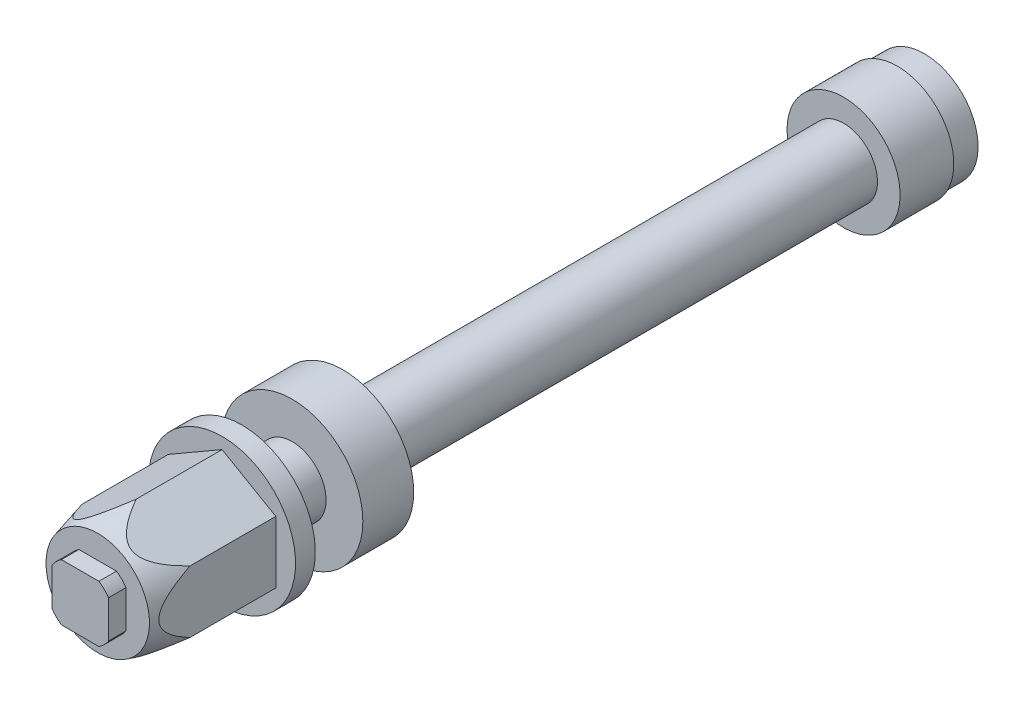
ISO-10303-21;
HEADER;
FILE_DESCRIPTION(('STEP AP214'),'2;1');
FILE_NAME('part.step','',(''),(''),'','','');
FILE_SCHEMA(('AUTOMOTIVE_DESIGN { 1 0 10303 214 1 1 1 1 }'));
ENDSEC;
DATA;
#1=APPLICATION_CONTEXT('core data for automotive mechanical design processes');
#2=APPLICATION_PROTOCOL_DEFINITION('international standard','automotive_design',2000,#1);
#3=PRODUCT_CONTEXT('',#1,'mechanical');
#4=PRODUCT('Part','Part','',(#3));
#5=PRODUCT_RELATED_PRODUCT_CATEGORY('part','',(#4));
#6=PRODUCT_DEFINITION_FORMATION('','',#4);
#7=PRODUCT_DEFINITION_CONTEXT('part definition',#1,'design');
#8=PRODUCT_DEFINITION('design','',#6,#7);
#9=PRODUCT_DEFINITION_SHAPE('','',#8);
#10=(LENGTH_UNIT() NAMED_UNIT(*) SI_UNIT(.MILLI.,.METRE.));
#11=(NAMED_UNIT(*) PLANE_ANGLE_UNIT() SI_UNIT($,.RADIAN.));
#12=(NAMED_UNIT(*) SI_UNIT($,.STERADIAN.) SOLID_ANGLE_UNIT());
#13=UNCERTAINTY_MEASURE_WITH_UNIT(LENGTH_MEASURE(1.E-05),#10,'distance_accuracy_value','');
#14=(GEOMETRIC_REPRESENTATION_CONTEXT(3) GLOBAL_UNCERTAINTY_ASSIGNED_CONTEXT((#13)) GLOBAL_UNIT_ASSIGNED_CONTEXT((#10,
#11,#12)) REPRESENTATION_CONTEXT('',''));
#15=CARTESIAN_POINT('',(0.,0.,0.));
#16=DIRECTION('',(0.,0.,1.));
#17=DIRECTION('',(1.,0.,0.));
#18=AXIS2_PLACEMENT_3D('',#15,#16,#17);
#19=CARTESIAN_POINT('',(-5.,-5.,29.));
#20=DIRECTION('',(0.,0.,1.));
#21=DIRECTION('',(1.,0.,0.));
#22=AXIS2_PLACEMENT_3D('',#19,#20,#21);
#23=PLANE('',#22);
#24=CARTESIAN_POINT('',(0.,0.,29.));
#25=DIRECTION('',(0.,0.,1.));
#26=DIRECTION('',(1.,0.,0.));
#27=AXIS2_PLACEMENT_3D('',#24,#25,#26);
#28=CIRCLE('',#27,6.);
#29=CARTESIAN_POINT('',(-5.00000000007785,-3.31662479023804,29.));
#30=VERTEX_POINT('',#29);
#31=CARTESIAN_POINT('',(-3.31662479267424,-4.99999999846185,29.));
#32=VERTEX_POINT('',#31);
#33=EDGE_CURVE('E335',#30,#32,#28,.T.);
#34=ORIENTED_EDGE('',*,*,#33,.T.);
#35=DIRECTION('',(1.,0.,0.));
#36=VECTOR('',#35,1.);
#37=CARTESIAN_POINT('',(-2.49999603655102E-09,-5.,29.));
#38=LINE('',#37,#36);
#39=CARTESIAN_POINT('',(3.31662479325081,-4.99999999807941,29.));
#40=VERTEX_POINT('',#39);
#41=EDGE_CURVE('E113',#32,#40,#38,.T.);
#42=ORIENTED_EDGE('',*,*,#41,.T.);
#43=CARTESIAN_POINT('',(0.,0.,29.));
#44=DIRECTION('',(0.,0.,1.));
#45=DIRECTION('',(1.,0.,0.));
#46=AXIS2_PLACEMENT_3D('',#43,#44,#45);
#47=CIRCLE('',#46,6.);
#48=CARTESIAN_POINT('',(5.,-3.3166247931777,29.));
#49=VERTEX_POINT('',#48);
#50=EDGE_CURVE('E18',#40,#49,#47,.T.);
#51=ORIENTED_EDGE('',*,*,#50,.T.);
#52=DIRECTION('',(0.,1.,0.));
#53=VECTOR('',#52,1.);
#54=CARTESIAN_POINT('',(5.,-4.99996044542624E-10,29.));
#55=LINE('',#54,#53);
#56=CARTESIAN_POINT('',(5.0000000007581,3.31662478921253,29.));
#57=VERTEX_POINT('',#56);
#58=EDGE_CURVE('E118',#49,#57,#55,.T.);
#59=ORIENTED_EDGE('',*,*,#58,.T.);
#60=CARTESIAN_POINT('',(0.,0.,29.));
#61=DIRECTION('',(0.,0.,1.));
#62=DIRECTION('',(1.,0.,0.));
#63=AXIS2_PLACEMENT_3D('',#60,#61,#62);
#64=CIRCLE('',#63,6.);
#65=CARTESIAN_POINT('',(3.31662479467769,5.,29.));
#66=VERTEX_POINT('',#65);
#67=EDGE_CURVE('E136',#57,#66,#64,.T.);
#68=ORIENTED_EDGE('',*,*,#67,.T.);
#69=DIRECTION('',(-1.,0.,0.));
#70=VECTOR('',#69,1.);
#71=CARTESIAN_POINT('',(1.49999604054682E-09,5.,29.));
#72=LINE('',#71,#70);
#73=CARTESIAN_POINT('',(-3.31662478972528,5.00000000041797,29.));
#74=VERTEX_POINT('',#73);
#75=EDGE_CURVE('E139',#66,#74,#72,.T.);
#76=ORIENTED_EDGE('',*,*,#75,.T.);
#77=CARTESIAN_POINT('',(0.,0.,29.));
#78=DIRECTION('',(0.,0.,1.));
#79=DIRECTION('',(1.,0.,0.));
#80=AXIS2_PLACEMENT_3D('',#77,#78,#79);
#81=CIRCLE('',#80,6.);
#82=CARTESIAN_POINT('',(-5.,3.31662479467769,29.));
#83=VERTEX_POINT('',#82);
#84=EDGE_CURVE('E338',#74,#83,#81,.T.);
#85=ORIENTED_EDGE('',*,*,#84,.T.);
#86=DIRECTION('',(0.,-1.,0.));
#87=VECTOR('',#86,1.);
#88=CARTESIAN_POINT('',(-5.,1.49999604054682E-09,29.));
#89=LINE('',#88,#87);
#90=EDGE_CURVE('E351',#83,#30,#89,.T.);
#91=ORIENTED_EDGE('',*,*,#90,.T.);
#92=EDGE_LOOP('',(#34,#42,#51,#59,#68,#76,#85,#91));
#93=FACE_BOUND('',#92,.T.);
#94=ADVANCED_FACE('F14',(#93),#23,.T.);
#95=CARTESIAN_POINT('',(3.31662479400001,-5.,25.9));
#96=DIRECTION('',(0.,1.,0.));
#97=DIRECTION('',(-1.,0.,0.));
#98=AXIS2_PLACEMENT_3D('',#95,#96,#97);
#99=PLANE('',#98);
#100=DIRECTION('',(0.,0.,1.));
#101=VECTOR('',#100,1.);
#102=CARTESIAN_POINT('',(-3.31662479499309,-4.9999999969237,27.45));
#103=LINE('',#102,#101);
#104=CARTESIAN_POINT('',(-3.31662479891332,-4.99999999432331,25.9));
#105=VERTEX_POINT('',#104);
#106=EDGE_CURVE('E352',#32,#105,#103,.F.);
#107=ORIENTED_EDGE('',*,*,#106,.T.);
#108=DIRECTION('',(1.,0.,0.));
#109=VECTOR('',#108,1.);
#110=CARTESIAN_POINT('',(0.,-4.99999999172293,25.9));
#111=LINE('',#110,#109);
#112=CARTESIAN_POINT('',(3.31662479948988,-4.99999999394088,25.9));
#113=VERTEX_POINT('',#112);
#114=EDGE_CURVE('E334',#105,#113,#111,.T.);
#115=ORIENTED_EDGE('',*,*,#114,.T.);
#116=DIRECTION('',(0.,0.,-1.));
#117=VECTOR('',#116,1.);
#118=CARTESIAN_POINT('',(3.3166247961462,-4.99999999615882,27.45));
#119=LINE('',#118,#117);
#120=EDGE_CURVE('E123',#113,#40,#119,.F.);
#121=ORIENTED_EDGE('',*,*,#120,.T.);
#122=ORIENTED_EDGE('',*,*,#41,.F.);
#123=EDGE_LOOP('',(#107,#115,#121,#122));
#124=FACE_BOUND('',#123,.T.);
#125=ADVANCED_FACE('F277',(#124),#99,.F.);
#126=CARTESIAN_POINT('',(0.,0.,25.9));
#127=DIRECTION('',(0.,0.,1.));
#128=DIRECTION('',(1.,0.,0.));
#129=AXIS2_PLACEMENT_3D('',#126,#127,#128);
#130=CYLINDRICAL_SURFACE('',#129,6.);
#131=ORIENTED_EDGE('',*,*,#120,.F.);
#132=CARTESIAN_POINT('',(0.,0.,25.9));
#133=DIRECTION('',(0.,0.,1.));
#134=DIRECTION('',(1.,0.,0.));
#135=AXIS2_PLACEMENT_3D('',#132,#133,#134);
#136=CIRCLE('',#135,6.);
#137=CARTESIAN_POINT('',(4.99999999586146,-3.31662479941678,25.9));
#138=VERTEX_POINT('',#137);
#139=EDGE_CURVE('E127',#113,#138,#136,.T.);
#140=ORIENTED_EDGE('',*,*,#139,.T.);
#141=DIRECTION('',(0.,0.,1.));
#142=VECTOR('',#141,1.);
#143=CARTESIAN_POINT('',(5.,-3.316624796,27.45));
#144=LINE('',#143,#142);
#145=EDGE_CURVE('E122',#138,#49,#144,.T.);
#146=ORIENTED_EDGE('',*,*,#145,.T.);
#147=ORIENTED_EDGE('',*,*,#50,.F.);
#148=EDGE_LOOP('',(#131,#140,#146,#147));
#149=FACE_BOUND('',#148,.T.);
#150=ADVANCED_FACE('F125',(#149),#130,.T.);
#151=CARTESIAN_POINT('',(5.,3.31662479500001,25.9));
#152=DIRECTION('',(-1.,0.,0.));
#153=DIRECTION('',(0.,-1.,0.));
#154=AXIS2_PLACEMENT_3D('',#151,#152,#153);
#155=PLANE('',#154);
#156=ORIENTED_EDGE('',*,*,#145,.F.);
#157=DIRECTION('',(0.,1.,0.));
#158=VECTOR('',#157,1.);
#159=CARTESIAN_POINT('',(4.99999999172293,0.,25.9));
#160=LINE('',#159,#158);
#161=CARTESIAN_POINT('',(4.99999999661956,3.31662479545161,25.9));
#162=VERTEX_POINT('',#161);
#163=EDGE_CURVE('E332',#138,#162,#160,.T.);
#164=ORIENTED_EDGE('',*,*,#163,.T.);
#165=DIRECTION('',(0.,0.,-1.));
#166=VECTOR('',#165,1.);
#167=CARTESIAN_POINT('',(5.0000000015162,3.31662478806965,27.45));
#168=LINE('',#167,#166);
#169=EDGE_CURVE('E133',#162,#57,#168,.F.);
#170=ORIENTED_EDGE('',*,*,#169,.T.);
#171=ORIENTED_EDGE('',*,*,#58,.F.);
#172=EDGE_LOOP('',(#156,#164,#170,#171));
#173=FACE_BOUND('',#172,.T.);
#174=ADVANCED_FACE('F131',(#173),#155,.F.);
#175=CARTESIAN_POINT('',(0.,0.,25.9));
#176=DIRECTION('',(0.,0.,1.));
#177=DIRECTION('',(1.,0.,0.));
#178=AXIS2_PLACEMENT_3D('',#175,#176,#177);
#179=CYLINDRICAL_SURFACE('',#178,6.);
#180=ORIENTED_EDGE('',*,*,#169,.F.);
#181=CARTESIAN_POINT('',(0.,0.,25.9));
#182=DIRECTION('',(0.,0.,1.));
#183=DIRECTION('',(1.,0.,0.));
#184=AXIS2_PLACEMENT_3D('',#181,#182,#183);
#185=CIRCLE('',#184,6.);
#186=CARTESIAN_POINT('',(3.31662480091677,4.99999999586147,25.9));
#187=VERTEX_POINT('',#186);
#188=EDGE_CURVE('E330',#162,#187,#185,.T.);
#189=ORIENTED_EDGE('',*,*,#188,.T.);
#190=DIRECTION('',(0.,0.,1.));
#191=VECTOR('',#190,1.);
#192=CARTESIAN_POINT('',(3.316624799,5.,27.45));
#193=LINE('',#192,#191);
#194=EDGE_CURVE('E341',#187,#66,#193,.T.);
#195=ORIENTED_EDGE('',*,*,#194,.T.);
#196=ORIENTED_EDGE('',*,*,#67,.F.);
#197=EDGE_LOOP('',(#180,#189,#195,#196));
#198=FACE_BOUND('',#197,.T.);
#199=ADVANCED_FACE('F283',(#198),#179,.T.);
#200=CARTESIAN_POINT('',(-3.31662479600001,5.,25.9));
#201=DIRECTION('',(0.,-1.,0.));
#202=DIRECTION('',(1.,0.,0.));
#203=AXIS2_PLACEMENT_3D('',#200,#201,#202);
#204=PLANE('',#203);
#205=ORIENTED_EDGE('',*,*,#194,.F.);
#206=DIRECTION('',(-1.,0.,0.));
#207=VECTOR('',#206,1.);
#208=CARTESIAN_POINT('',(0.,4.99999999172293,25.9));
#209=LINE('',#208,#207);
#210=CARTESIAN_POINT('',(-3.31662479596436,4.99999999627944,25.9));
#211=VERTEX_POINT('',#210);
#212=EDGE_CURVE('E329',#187,#211,#209,.T.);
#213=ORIENTED_EDGE('',*,*,#212,.T.);
#214=DIRECTION('',(0.,0.,-1.));
#215=VECTOR('',#214,1.);
#216=CARTESIAN_POINT('',(-3.31662478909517,5.00000000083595,27.45));
#217=LINE('',#216,#215);
#218=EDGE_CURVE('E340',#211,#74,#217,.F.);
#219=ORIENTED_EDGE('',*,*,#218,.T.);
#220=ORIENTED_EDGE('',*,*,#75,.F.);
#221=EDGE_LOOP('',(#205,#213,#219,#220));
#222=FACE_BOUND('',#221,.T.);
#223=ADVANCED_FACE('F284',(#222),#204,.F.);
#224=CARTESIAN_POINT('',(0.,0.,25.9));
#225=DIRECTION('',(0.,0.,1.));
#226=DIRECTION('',(1.,0.,0.));
#227=AXIS2_PLACEMENT_3D('',#224,#225,#226);
#228=CYLINDRICAL_SURFACE('',#227,6.);
#229=ORIENTED_EDGE('',*,*,#218,.F.);
#230=CARTESIAN_POINT('',(0.,0.,25.9));
#231=DIRECTION('',(0.,0.,1.));
#232=DIRECTION('',(1.,0.,0.));
#233=AXIS2_PLACEMENT_3D('',#230,#231,#232);
#234=CIRCLE('',#233,6.);
#235=CARTESIAN_POINT('',(-4.99999999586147,3.31662480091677,25.9));
#236=VERTEX_POINT('',#235);
#237=EDGE_CURVE('E327',#211,#236,#234,.T.);
#238=ORIENTED_EDGE('',*,*,#237,.T.);
#239=DIRECTION('',(0.,0.,1.));
#240=VECTOR('',#239,1.);
#241=CARTESIAN_POINT('',(-5.,3.316624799,27.45));
#242=LINE('',#241,#240);
#243=EDGE_CURVE('E339',#236,#83,#242,.T.);
#244=ORIENTED_EDGE('',*,*,#243,.T.);
#245=ORIENTED_EDGE('',*,*,#84,.F.);
#246=EDGE_LOOP('',(#229,#238,#244,#245));
#247=FACE_BOUND('',#246,.T.);
#248=ADVANCED_FACE('F287',(#247),#228,.T.);
#249=CARTESIAN_POINT('',(-5.,-3.31662479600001,25.9));
#250=DIRECTION('',(1.,0.,0.));
#251=DIRECTION('',(0.,1.,0.));
#252=AXIS2_PLACEMENT_3D('',#249,#250,#251);
#253=PLANE('',#252);
#254=ORIENTED_EDGE('',*,*,#243,.F.);
#255=DIRECTION('',(0.,-1.,0.));
#256=VECTOR('',#255,1.);
#257=CARTESIAN_POINT('',(-4.99999999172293,0.,25.9));
#258=LINE('',#257,#256);
#259=CARTESIAN_POINT('',(-4.99999999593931,-3.31662479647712,25.9));
#260=VERTEX_POINT('',#259);
#261=EDGE_CURVE('E326',#236,#260,#258,.T.);
#262=ORIENTED_EDGE('',*,*,#261,.T.);
#263=DIRECTION('',(0.,0.,-1.));
#264=VECTOR('',#263,1.);
#265=CARTESIAN_POINT('',(-5.0000000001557,-3.31662479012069,27.45));
#266=LINE('',#265,#264);
#267=EDGE_CURVE('E337',#260,#30,#266,.F.);
#268=ORIENTED_EDGE('',*,*,#267,.T.);
#269=ORIENTED_EDGE('',*,*,#90,.F.);
#270=EDGE_LOOP('',(#254,#262,#268,#269));
#271=FACE_BOUND('',#270,.T.);
#272=ADVANCED_FACE('F289',(#271),#253,.F.);
#273=CARTESIAN_POINT('',(0.,0.,25.9));
#274=DIRECTION('',(0.,0.,1.));
#275=DIRECTION('',(1.,0.,0.));
#276=AXIS2_PLACEMENT_3D('',#273,#274,#275);
#277=CYLINDRICAL_SURFACE('',#276,6.);
#278=ORIENTED_EDGE('',*,*,#267,.F.);
#279=CARTESIAN_POINT('',(0.,0.,25.9));
#280=DIRECTION('',(0.,0.,1.));
#281=DIRECTION('',(1.,0.,0.));
#282=AXIS2_PLACEMENT_3D('',#279,#280,#281);
#283=CIRCLE('',#282,6.);
#284=EDGE_CURVE('E323',#260,#105,#283,.T.);
#285=ORIENTED_EDGE('',*,*,#284,.T.);
#286=ORIENTED_EDGE('',*,*,#106,.F.);
#287=ORIENTED_EDGE('',*,*,#33,.F.);
#288=EDGE_LOOP('',(#278,#285,#286,#287));
#289=FACE_BOUND('',#288,.T.);
#290=ADVANCED_FACE('F292',(#289),#277,.T.);
#291=CARTESIAN_POINT('',(9.26080236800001,-9.26080236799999,25.9));
#292=DIRECTION('',(0.,0.,-1.));
#293=DIRECTION('',(-1.,0.,0.));
#294=AXIS2_PLACEMENT_3D('',#291,#292,#293);
#295=PLANE('',#294);
#296=ORIENTED_EDGE('',*,*,#261,.F.);
#297=ORIENTED_EDGE('',*,*,#237,.F.);
#298=ORIENTED_EDGE('',*,*,#212,.F.);
#299=ORIENTED_EDGE('',*,*,#188,.F.);
#300=ORIENTED_EDGE('',*,*,#163,.F.);
#301=ORIENTED_EDGE('',*,*,#139,.F.);
#302=ORIENTED_EDGE('',*,*,#114,.F.);
#303=ORIENTED_EDGE('',*,*,#284,.F.);
#304=EDGE_LOOP('',(#296,#297,#298,#299,#300,#301,#302,#303));
#305=FACE_BOUND('',#304,.T.);
#306=CARTESIAN_POINT('',(0.,0.,25.9));
#307=DIRECTION('',(0.,0.,-1.));
#308=DIRECTION('',(-1.,0.,0.));
#309=AXIS2_PLACEMENT_3D('',#306,#307,#308);
#310=CIRCLE('',#309,9.15099048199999);
#311=CARTESIAN_POINT('',(-9.15099048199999,0.,25.9));
#312=VERTEX_POINT('',#311);
#313=EDGE_CURVE('E315',#312,#312,#310,.F.);
#314=ORIENTED_EDGE('',*,*,#313,.T.);
#315=EDGE_LOOP('',(#314));
#316=FACE_BOUND('',#315,.T.);
#317=ADVANCED_FACE('F294',(#305,#316),#295,.F.);
#318=CARTESIAN_POINT('',(0.,0.,25.9));
#319=DIRECTION('',(0.,0.,-1.));
#320=DIRECTION('',(-1.,0.,0.));
#321=AXIS2_PLACEMENT_3D('',#318,#319,#320);
#322=CONICAL_SURFACE('',#321,9.150990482,0.261799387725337);
#323=CARTESIAN_POINT('',(-6.20868162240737E-09,10.9696551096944,19.1126511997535));
#324=CARTESIAN_POINT('',(-0.0634488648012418,10.9330228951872,19.2493562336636));
#325=CARTESIAN_POINT('',(-0.127631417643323,10.8959670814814,19.3856060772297));
#326=CARTESIAN_POINT('',(-0.257633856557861,10.8209101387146,19.6570747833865));
#327=CARTESIAN_POINT('',(-0.323453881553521,10.7829089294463,19.7922935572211));
#328=CARTESIAN_POINT('',(-0.523848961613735,10.667210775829,20.1966722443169));
#329=CARTESIAN_POINT('',(-0.661131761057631,10.5879505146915,20.4640613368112));
#330=CARTESIAN_POINT('',(-0.946289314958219,10.4233147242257,20.9956178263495));
#331=CARTESIAN_POINT('',(-1.09427022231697,10.3378779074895,21.2597096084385));
#332=CARTESIAN_POINT('',(-1.40172472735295,10.1603689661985,21.778663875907));
#333=CARTESIAN_POINT('',(-1.56118902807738,10.0683022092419,22.0335335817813));
#334=CARTESIAN_POINT('',(-1.80700454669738,9.92638055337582,22.3987192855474));
#335=CARTESIAN_POINT('',(-1.88749663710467,9.87990842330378,22.5142972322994));
#336=CARTESIAN_POINT('',(-2.05236072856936,9.78472409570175,22.7417441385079));
#337=CARTESIAN_POINT('',(-2.1367331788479,9.7360116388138,22.8536126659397));
#338=CARTESIAN_POINT('',(-2.30985609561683,9.63605907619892,23.0726406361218));
#339=CARTESIAN_POINT('',(-2.39860372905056,9.58482060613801,23.1798030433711));
#340=CARTESIAN_POINT('',(-2.58115638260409,9.47942378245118,23.3881875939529));
#341=CARTESIAN_POINT('',(-2.67496035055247,9.4252660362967,23.4894109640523));
#342=CARTESIAN_POINT('',(-2.92331830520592,9.28187650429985,23.7396866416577));
#343=CARTESIAN_POINT('',(-3.08212147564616,9.19019145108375,23.8832583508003));
#344=CARTESIAN_POINT('',(-3.41643833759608,8.9971735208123,24.1416779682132));
#345=CARTESIAN_POINT('',(-3.59190139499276,8.89586987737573,24.2566092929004));
#346=CARTESIAN_POINT('',(-3.8986995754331,8.71873986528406,24.4120548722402));
#347=CARTESIAN_POINT('',(-4.02538741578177,8.64559660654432,24.4646084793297));
#348=CARTESIAN_POINT('',(-4.2845097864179,8.49599223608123,24.5451218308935));
#349=CARTESIAN_POINT('',(-4.41693645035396,8.41953566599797,24.573114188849));
#350=CARTESIAN_POINT('',(-4.68483156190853,8.26486635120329,24.6010793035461));
#351=CARTESIAN_POINT('',(-4.82031300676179,8.18664610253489,24.6008921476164));
#352=CARTESIAN_POINT('',(-5.088980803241,8.0315306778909,24.572131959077));
#353=CARTESIAN_POINT('',(-5.22216570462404,7.95463633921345,24.5435416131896));
#354=CARTESIAN_POINT('',(-5.51004033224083,7.78843184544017,24.4529690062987));
#355=CARTESIAN_POINT('',(-5.6633373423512,7.69992577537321,24.3852134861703));
#356=CARTESIAN_POINT('',(-5.95867005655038,7.5294153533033,24.2225226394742));
#357=CARTESIAN_POINT('',(-6.10067910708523,7.44742638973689,24.1275252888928));
#358=CARTESIAN_POINT('',(-6.35825831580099,7.29871296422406,23.9300827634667));
#359=CARTESIAN_POINT('',(-6.47501165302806,7.23130539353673,23.8296450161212));
#360=CARTESIAN_POINT('',(-6.70072155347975,7.1009917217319,23.6175948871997));
#361=CARTESIAN_POINT('',(-6.80967100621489,7.03808972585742,23.5059725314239));
#362=CARTESIAN_POINT('',(-7.02146523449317,6.91581027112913,23.2736789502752));
#363=CARTESIAN_POINT('',(-7.12426171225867,6.85646069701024,23.1529496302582));
#364=CARTESIAN_POINT('',(-7.3238811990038,6.74121033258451,22.905214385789));
#365=CARTESIAN_POINT('',(-7.42070658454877,6.68530817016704,22.7782109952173));
#366=CARTESIAN_POINT('',(-7.6148771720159,6.57320372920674,22.511647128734));
#367=CARTESIAN_POINT('',(-7.71191369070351,6.51717966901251,22.3717884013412));
#368=CARTESIAN_POINT('',(-7.90115733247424,6.40791980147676,22.0877653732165));
#369=CARTESIAN_POINT('',(-7.99336354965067,6.35468451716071,21.9436002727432));
#370=CARTESIAN_POINT('',(-8.26401505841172,6.19842379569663,21.5056561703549));
#371=CARTESIAN_POINT('',(-8.43625499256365,6.09898102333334,21.2067650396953));
#372=CARTESIAN_POINT('',(-8.76209449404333,5.91085749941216,20.611274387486));
#373=CARTESIAN_POINT('',(-8.91614852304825,5.82191436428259,20.3150011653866));
#374=CARTESIAN_POINT('',(-9.1401546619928,5.6925843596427,19.8665652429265));
#375=CARTESIAN_POINT('',(-9.21352966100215,5.65022128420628,19.7166646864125));
#376=CARTESIAN_POINT('',(-9.35823700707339,5.56667445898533,19.4155785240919));
#377=CARTESIAN_POINT('',(-9.42956961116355,5.52549056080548,19.2643930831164));
#378=CARTESIAN_POINT('',(-9.49999999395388,5.48482756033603,19.1126512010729));
#379=B_SPLINE_CURVE_WITH_KNOTS('',3,(#323,#324,#325,#326,#327,#328,#329,#330,#331,#332,#333,
#334,#335,#336,#337,#338,#339,#340,#341,#342,#343,#344,#345,#346,#347,#348,#349,#350,#351,#352,
#353,#354,#355,#356,#357,#358,#359,#360,#361,#362,#363,#364,#365,#366,#367,#368,#369,#370,#371,
#372,#373,#374,#375,#376,#377,#378),.UNSPECIFIED.,.F.,.F.,(4,2,2,2,2,2,2,2,2,2,2,2,2,2,2,2,2,2,
2,2,2,2,2,2,2,2,2,4),(0.,0.46529257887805,0.930624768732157,1.86296450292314,2.80634177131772,
3.74896368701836,4.19381456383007,4.63871707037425,5.08333517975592,5.52786112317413,
6.22481389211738,6.91971238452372,7.38431302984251,7.84829582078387,8.31491171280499,
8.78181220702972,9.34723824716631,9.91396200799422,10.4175759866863,10.9216431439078,
11.4292537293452,11.9366609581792,12.4741121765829,13.0116638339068,14.0880685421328,
15.1245428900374,15.6410886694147,16.1575691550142),.UNSPECIFIED.);
#380=CARTESIAN_POINT('',(0.,10.9696551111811,19.1126511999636));
#381=VERTEX_POINT('',#380);
#382=CARTESIAN_POINT('',(-9.49999999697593,5.48482755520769,19.1126512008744));
#383=VERTEX_POINT('',#382);
#384=EDGE_CURVE('E203',#381,#383,#379,.T.);
#385=ORIENTED_EDGE('',*,*,#384,.T.);
#386=CARTESIAN_POINT('',(-9.49999999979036,5.48482755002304,19.1126512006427));
#387=CARTESIAN_POINT('',(-9.49999999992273,5.41128480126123,19.2498754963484));
#388=CARTESIAN_POINT('',(-9.49999999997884,5.33688846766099,19.3866411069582));
#389=CARTESIAN_POINT('',(-9.50000000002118,5.18619002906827,19.6591330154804));
#390=CARTESIAN_POINT('',(-9.5000000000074,5.1098877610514,19.7948592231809));
#391=CARTESIAN_POINT('',(-9.4999999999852,4.87756577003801,20.2007453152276));
#392=CARTESIAN_POINT('',(-9.49999999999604,4.71839330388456,20.4691194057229));
#393=CARTESIAN_POINT('',(-9.50000000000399,4.38896415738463,21.0005762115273));
#394=CARTESIAN_POINT('',(-9.50000000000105,4.21866340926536,21.263631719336));
#395=CARTESIAN_POINT('',(-9.49999999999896,3.86487531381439,21.7805721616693));
#396=CARTESIAN_POINT('',(-9.49999999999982,3.68139851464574,22.0344641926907));
#397=CARTESIAN_POINT('',(-9.50000000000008,3.40393890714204,22.3914366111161));
#398=CARTESIAN_POINT('',(-9.50000000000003,3.31688903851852,22.4999128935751));
#399=CARTESIAN_POINT('',(-9.49999999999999,3.13888608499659,22.7136397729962));
#400=CARTESIAN_POINT('',(-9.5,3.04793278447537,22.818890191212));
#401=CARTESIAN_POINT('',(-9.50000000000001,2.86131579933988,23.0257346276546));
#402=CARTESIAN_POINT('',(-9.5,2.76563859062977,23.127316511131));
#403=CARTESIAN_POINT('',(-9.50000000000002,2.56923610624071,23.325466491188));
#404=CARTESIAN_POINT('',(-9.50000000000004,2.46851150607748,23.422035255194));
#405=CARTESIAN_POINT('',(-9.49999999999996,2.25954610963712,23.6104173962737));
#406=CARTESIAN_POINT('',(-9.49999999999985,2.15120799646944,23.7021246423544));
#407=CARTESIAN_POINT('',(-9.50000000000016,1.92793405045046,23.8770554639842));
#408=CARTESIAN_POINT('',(-9.50000000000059,1.81299577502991,23.9602758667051));
#409=CARTESIAN_POINT('',(-9.49999999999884,1.45836098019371,24.1925819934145));
#410=CARTESIAN_POINT('',(-9.49999999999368,1.20721115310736,24.3258820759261));
#411=CARTESIAN_POINT('',(-9.5000000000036,0.791928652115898,24.4789033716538));
#412=CARTESIAN_POINT('',(-9.50000000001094,0.636775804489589,24.5228166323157));
#413=CARTESIAN_POINT('',(-9.49999999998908,0.321082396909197,24.5820894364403));
#414=CARTESIAN_POINT('',(-9.49999999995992,0.160549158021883,24.597486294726));
#415=CARTESIAN_POINT('',(-9.49999999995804,-0.169756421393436,24.5974707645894));
#416=CARTESIAN_POINT('',(-9.49999999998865,-0.339530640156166,24.5802408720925));
#417=CARTESIAN_POINT('',(-9.50000000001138,-0.672828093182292,24.5141336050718));
#418=CARTESIAN_POINT('',(-9.50000000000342,-0.836339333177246,24.4651984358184));
#419=CARTESIAN_POINT('',(-9.49999999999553,-1.20174866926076,24.3232046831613));
#420=CARTESIAN_POINT('',(-9.4999999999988,-1.40009749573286,24.2212298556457));
#421=CARTESIAN_POINT('',(-9.50000000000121,-1.77876953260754,23.9881273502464));
#422=CARTESIAN_POINT('',(-9.50000000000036,-1.95903926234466,23.8569166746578));
#423=CARTESIAN_POINT('',(-9.49999999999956,-2.34427513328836,23.5421996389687));
#424=CARTESIAN_POINT('',(-9.49999999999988,-2.5450493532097,23.3536562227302));
#425=CARTESIAN_POINT('',(-9.50000000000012,-2.92786371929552,22.9581956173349));
#426=CARTESIAN_POINT('',(-9.50000000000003,-3.10986608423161,22.7512428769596));
#427=CARTESIAN_POINT('',(-9.49999999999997,-3.46019665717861,22.3240031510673));
#428=CARTESIAN_POINT('',(-9.49999999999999,-3.62843064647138,22.1036398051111));
#429=CARTESIAN_POINT('',(-9.50000000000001,-3.95301175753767,21.6546847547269));
#430=CARTESIAN_POINT('',(-9.5,-4.10936844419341,21.4260998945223));
#431=CARTESIAN_POINT('',(-9.5,-4.37214622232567,21.0247328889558));
#432=CARTESIAN_POINT('',(-9.5,-4.48074507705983,20.8533638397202));
#433=CARTESIAN_POINT('',(-9.5,-4.69361338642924,20.5079259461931));
#434=CARTESIAN_POINT('',(-9.5,-4.79788220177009,20.3338567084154));
#435=CARTESIAN_POINT('',(-9.5,-5.00107097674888,19.9862317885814));
#436=CARTESIAN_POINT('',(-9.5,-5.10004869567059,19.8127097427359));
#437=CARTESIAN_POINT('',(-9.5,-5.29475670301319,19.4639201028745));
#438=CARTESIAN_POINT('',(-9.5,-5.39048796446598,19.2886530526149));
#439=CARTESIAN_POINT('',(-9.5,-5.48482754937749,19.1126512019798));
#440=B_SPLINE_CURVE_WITH_KNOTS('',3,(#386,#387,#388,#389,#390,#391,#392,#393,#394,#395,#396,
#397,#398,#399,#400,#401,#402,#403,#404,#405,#406,#407,#408,#409,#410,#411,#412,#413,#414,#415,
#416,#417,#418,#419,#420,#421,#422,#423,#424,#425,#426,#427,#428,#429,#430,#431,#432,#433,#434,
#435,#436,#437,#438,#439),.UNSPECIFIED.,.F.,.F.,(4,2,2,2,2,2,2,2,2,2,2,2,2,2,2,2,2,2,2,2,2,2,2,
2,2,2,4),(0.,0.467059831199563,0.934159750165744,1.87003517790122,2.8098722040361,
3.74896505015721,4.16614936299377,4.5833567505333,5.00183697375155,5.42026133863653,
5.84566206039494,6.27122124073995,7.11561088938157,7.59717765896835,8.0781138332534,
8.58663100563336,9.09607775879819,9.76129215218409,10.4284196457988,11.2527677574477,
12.0787438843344,12.909967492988,13.7405144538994,14.3490945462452,14.9577641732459,
15.5570273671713,16.1561093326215),.UNSPECIFIED.);
#441=CARTESIAN_POINT('',(-9.49999999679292,-5.48482755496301,19.1126512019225));
#442=VERTEX_POINT('',#441);
#443=EDGE_CURVE('E373',#383,#442,#440,.T.);
#444=ORIENTED_EDGE('',*,*,#443,.T.);
#445=CARTESIAN_POINT('',(-9.49999999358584,-5.48482756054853,19.1126512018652));
#446=CARTESIAN_POINT('',(-9.43655113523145,-5.5214597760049,19.2493562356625));
#447=CARTESIAN_POINT('',(-9.3723685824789,-5.55851559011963,19.3856060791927));
#448=CARTESIAN_POINT('',(-9.24236614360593,-5.63357253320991,19.6570747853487));
#449=CARTESIAN_POINT('',(-9.17654611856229,-5.67157374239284,19.7922935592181));
#450=CARTESIAN_POINT('',(-8.9761510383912,-5.78727189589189,20.1966722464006));
#451=CARTESIAN_POINT('',(-8.83886823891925,-5.86653215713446,20.4640613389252));
#452=CARTESIAN_POINT('',(-8.55371068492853,-6.03116794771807,20.9956178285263));
#453=CARTESIAN_POINT('',(-8.40572977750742,-6.11660476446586,21.2597096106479));
#454=CARTESIAN_POINT('',(-8.09827527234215,-6.29411370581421,21.778663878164));
#455=CARTESIAN_POINT('',(-7.93881097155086,-6.38618046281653,22.0335335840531));
#456=CARTESIAN_POINT('',(-7.69299545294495,-6.52810211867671,22.3987192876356));
#457=CARTESIAN_POINT('',(-7.61250336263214,-6.57457424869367,22.5142972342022));
#458=CARTESIAN_POINT('',(-7.44763927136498,-6.66975857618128,22.7417441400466));
#459=CARTESIAN_POINT('',(-7.36326682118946,-6.71847103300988,22.8536126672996));
#460=CARTESIAN_POINT('',(-7.19014390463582,-6.81842359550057,23.0726406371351));
#461=CARTESIAN_POINT('',(-7.1013962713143,-6.86966206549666,23.1798030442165));
#462=CARTESIAN_POINT('',(-6.91884361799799,-6.97505888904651,23.388187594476));
#463=CARTESIAN_POINT('',(-6.82503965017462,-7.02921663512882,23.4894109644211));
#464=CARTESIAN_POINT('',(-6.57668169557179,-7.17260616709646,23.739686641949));
#465=CARTESIAN_POINT('',(-6.41787852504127,-7.26429122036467,23.8832583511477));
#466=CARTESIAN_POINT('',(-6.08356166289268,-7.45730915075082,24.1416779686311));
#467=CARTESIAN_POINT('',(-5.90809860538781,-7.55861279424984,24.2566092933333));
#468=CARTESIAN_POINT('',(-5.60130042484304,-7.73574280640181,24.4120548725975));
#469=CARTESIAN_POINT('',(-5.47461258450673,-7.80888606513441,24.4646084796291));
#470=CARTESIAN_POINT('',(-5.21549021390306,-7.95849043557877,24.545121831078));
#471=CARTESIAN_POINT('',(-5.08306354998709,-8.03494700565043,24.5731141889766));
#472=CARTESIAN_POINT('',(-4.81516843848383,-8.18961632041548,24.6010793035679));
#473=CARTESIAN_POINT('',(-4.67968699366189,-8.2678365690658,24.6008921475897));
#474=CARTESIAN_POINT('',(-4.41101919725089,-8.42295199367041,24.5721319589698));
#475=CARTESIAN_POINT('',(-4.27783429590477,-8.49984633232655,24.5435416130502));
#476=CARTESIAN_POINT('',(-3.98995966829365,-8.66605082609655,24.4529690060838));
#477=CARTESIAN_POINT('',(-3.83666265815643,-8.75455689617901,24.3852134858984));
#478=CARTESIAN_POINT('',(-3.54132994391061,-8.92506731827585,24.2225226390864));
#479=CARTESIAN_POINT('',(-3.39932089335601,-9.00705628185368,24.1275252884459));
#480=CARTESIAN_POINT('',(-3.14174168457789,-9.15576970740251,23.9300827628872));
#481=CARTESIAN_POINT('',(-3.02498834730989,-9.22317727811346,23.8296450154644));
#482=CARTESIAN_POINT('',(-2.7992784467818,-9.35349094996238,23.6175948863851));
#483=CARTESIAN_POINT('',(-2.69032899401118,-9.41639294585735,23.5059725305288));
#484=CARTESIAN_POINT('',(-2.47853476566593,-9.53867240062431,23.2736789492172));
#485=CARTESIAN_POINT('',(-2.37573828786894,-9.59802197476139,23.152949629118));
#486=CARTESIAN_POINT('',(-2.17611880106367,-9.71327233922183,22.9052143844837));
#487=CARTESIAN_POINT('',(-2.07929341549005,-9.76917450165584,22.778210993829));
#488=CARTESIAN_POINT('',(-1.88512282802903,-9.88127894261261,22.5116471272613));
#489=CARTESIAN_POINT('',(-1.78808630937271,-9.93730300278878,22.3717883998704));
#490=CARTESIAN_POINT('',(-1.5988426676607,-10.0465628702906,22.0877653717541));
#491=CARTESIAN_POINT('',(-1.5066364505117,-10.0997981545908,21.9436002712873));
#492=CARTESIAN_POINT('',(-1.23598494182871,-10.2560588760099,21.5056561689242));
#493=CARTESIAN_POINT('',(-1.06374500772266,-10.3555016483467,21.2067650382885));
#494=CARTESIAN_POINT('',(-0.737905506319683,-10.5436251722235,20.6112743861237));
#495=CARTESIAN_POINT('',(-0.583851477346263,-10.6325683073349,20.3150011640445));
#496=CARTESIAN_POINT('',(-0.359845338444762,-10.76189831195,19.8665652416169));
#497=CARTESIAN_POINT('',(-0.286470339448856,-10.8042613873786,19.7166646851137));
#498=CARTESIAN_POINT('',(-0.141762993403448,-10.8878082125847,19.4155785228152));
#499=CARTESIAN_POINT('',(-0.0704303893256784,-10.9289921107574,19.2643930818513));
#500=CARTESIAN_POINT('',(-6.54730727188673E-09,-10.9696551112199,19.1126511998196));
#501=B_SPLINE_CURVE_WITH_KNOTS('',3,(#445,#446,#447,#448,#449,#450,#451,#452,#453,#454,#455,
#456,#457,#458,#459,#460,#461,#462,#463,#464,#465,#466,#467,#468,#469,#470,#471,#472,#473,#474,
#475,#476,#477,#478,#479,#480,#481,#482,#483,#484,#485,#486,#487,#488,#489,#490,#491,#492,#493,
#494,#495,#496,#497,#498,#499,#500),.UNSPECIFIED.,.F.,.F.,(4,2,2,2,2,2,2,2,2,2,2,2,2,2,2,2,2,2,
2,2,2,2,2,2,2,2,2,4),(0.,0.465292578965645,0.930624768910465,1.86296450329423,2.80634177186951,
3.74896368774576,4.19381456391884,4.63871706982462,5.08333517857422,5.52786112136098,
6.22481389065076,6.91971238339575,7.3843130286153,7.848295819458,8.31491171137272,
8.78181220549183,9.34723824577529,9.91396200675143,10.4175759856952,10.9216431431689,
11.4292537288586,11.9366609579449,12.4741121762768,13.0116638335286,14.0880685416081,
15.1245428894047,15.6410886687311,16.1575691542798),.UNSPECIFIED.);
#502=CARTESIAN_POINT('',(0.,-10.9696551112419,19.1126511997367));
#503=VERTEX_POINT('',#502);
#504=EDGE_CURVE('E376',#442,#503,#501,.T.);
#505=ORIENTED_EDGE('',*,*,#504,.T.);
#506=CARTESIAN_POINT('',(6.10256050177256E-09,-10.9696551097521,19.1126511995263));
#507=CARTESIAN_POINT('',(0.0634488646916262,-10.9330228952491,19.2493562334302));
#508=CARTESIAN_POINT('',(0.127631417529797,-10.8959670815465,19.38560607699));
#509=CARTESIAN_POINT('',(0.257633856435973,-10.8209101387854,19.6570747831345));
#510=CARTESIAN_POINT('',(0.32345388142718,-10.7829089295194,19.7922935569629));
#511=CARTESIAN_POINT('',(0.523848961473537,-10.6672107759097,20.1966722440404));
#512=CARTESIAN_POINT('',(0.661131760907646,-10.587950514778,20.4640613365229));
#513=CARTESIAN_POINT('',(0.946289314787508,-10.4233147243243,20.9956178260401));
#514=CARTESIAN_POINT('',(1.09427022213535,-10.3378779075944,21.2597096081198));
#515=CARTESIAN_POINT('',(1.40172472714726,-10.1603689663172,21.778663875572));
#516=CARTESIAN_POINT('',(1.56118902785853,-10.0683022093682,22.0335335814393));
#517=CARTESIAN_POINT('',(1.80700454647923,-9.92638055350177,22.3987192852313));
#518=CARTESIAN_POINT('',(1.88749663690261,-9.87990842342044,22.5142972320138));
#519=CARTESIAN_POINT('',(2.0523607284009,-9.78472409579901,22.7417441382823));
#520=CARTESIAN_POINT('',(2.13673317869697,-9.73601163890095,22.8536126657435));
#521=CARTESIAN_POINT('',(2.30985609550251,-9.63605907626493,23.0726406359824));
#522=CARTESIAN_POINT('',(2.39860372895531,-9.584820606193,23.1798030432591));
#523=CARTESIAN_POINT('',(2.58115638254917,-9.47942378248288,23.3881875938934));
#524=CARTESIAN_POINT('',(2.67496035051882,-9.42526603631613,23.4894109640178));
#525=CARTESIAN_POINT('',(2.9233183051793,-9.28187650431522,23.7396866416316));
#526=CARTESIAN_POINT('',(3.08212147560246,-9.19019145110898,23.8832583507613));
#527=CARTESIAN_POINT('',(3.41643833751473,-8.99717352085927,24.1416779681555));
#528=CARTESIAN_POINT('',(3.5919013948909,-8.89586987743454,24.2566092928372));
#529=CARTESIAN_POINT('',(3.89869957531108,-8.71873986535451,24.4120548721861));
#530=CARTESIAN_POINT('',(4.02538741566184,-8.64559660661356,24.4646084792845));
#531=CARTESIAN_POINT('',(4.28450978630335,-8.49599223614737,24.5451218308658));
#532=CARTESIAN_POINT('',(4.41693645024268,-8.41953566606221,24.5731141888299));
#533=CARTESIAN_POINT('',(4.68483156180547,-8.26486635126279,24.6010793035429));
#534=CARTESIAN_POINT('',(4.8203130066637,-8.18664610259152,24.6008921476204));
#535=CARTESIAN_POINT('',(5.08898080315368,-8.03153067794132,24.5721319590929));
#536=CARTESIAN_POINT('',(5.22216570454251,-7.95463633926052,24.5435416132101));
#537=CARTESIAN_POINT('',(5.5100403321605,-7.78843184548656,24.4529690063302));
#538=CARTESIAN_POINT('',(5.66333734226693,-7.69992577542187,24.3852134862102));
#539=CARTESIAN_POINT('',(5.95867005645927,-7.52941535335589,24.2225226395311));
#540=CARTESIAN_POINT('',(6.10067910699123,-7.44742638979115,24.1275252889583));
#541=CARTESIAN_POINT('',(6.35825831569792,-7.29871296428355,23.9300827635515));
#542=CARTESIAN_POINT('',(6.47501165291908,-7.23130539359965,23.8296450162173));
#543=CARTESIAN_POINT('',(6.7007215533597,-7.10099172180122,23.6175948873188));
#544=CARTESIAN_POINT('',(6.8096710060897,-7.0380897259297,23.5059725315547));
#545=CARTESIAN_POINT('',(7.02146523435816,-6.91581027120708,23.2736789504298));
#546=CARTESIAN_POINT('',(7.12426171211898,-6.85646069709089,23.1529496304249));
#547=CARTESIAN_POINT('',(7.32388119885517,-6.74121033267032,22.9052143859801));
#548=CARTESIAN_POINT('',(7.42070658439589,-6.68530817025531,22.7782109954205));
#549=CARTESIAN_POINT('',(7.61487717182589,-6.57320372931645,22.5116471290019));
#550=CARTESIAN_POINT('',(7.71191369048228,-6.51717966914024,22.371788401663));
#551=CARTESIAN_POINT('',(7.90115733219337,-6.40791980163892,22.0877653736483));
#552=CARTESIAN_POINT('',(7.99336354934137,-6.35468451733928,21.9436002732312));
#553=CARTESIAN_POINT('',(8.26401505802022,-6.19842379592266,21.5056561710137));
#554=CARTESIAN_POINT('',(8.43625499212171,-6.09898102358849,21.2067650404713));
#555=CARTESIAN_POINT('',(8.76209449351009,-5.91085749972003,20.6112743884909));
#556=CARTESIAN_POINT('',(8.91614852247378,-5.82191436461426,20.3150011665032));
#557=CARTESIAN_POINT('',(9.14015466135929,-5.69258436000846,19.8665652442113));
#558=CARTESIAN_POINT('',(9.21352966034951,-5.65022128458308,19.7166646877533));
#559=CARTESIAN_POINT('',(9.35823700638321,-5.56667445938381,19.415578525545));
#560=CARTESIAN_POINT('',(9.42956961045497,-5.52549056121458,19.2643930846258));
#561=CARTESIAN_POINT('',(9.49999999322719,-5.48482756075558,19.1126512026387));
#562=B_SPLINE_CURVE_WITH_KNOTS('',3,(#506,#507,#508,#509,#510,#511,#512,#513,#514,#515,#516,
#517,#518,#519,#520,#521,#522,#523,#524,#525,#526,#527,#528,#529,#530,#531,#532,#533,#534,#535,
#536,#537,#538,#539,#540,#541,#542,#543,#544,#545,#546,#547,#548,#549,#550,#551,#552,#553,#554,
#555,#556,#557,#558,#559,#560,#561),.UNSPECIFIED.,.F.,.F.,(4,2,2,2,2,2,2,2,2,2,2,2,2,2,2,2,2,2,
2,2,2,2,2,2,2,2,2,4),(0.,0.46529257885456,0.93062476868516,1.8629645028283,2.80634177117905,
3.74896368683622,4.19381456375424,4.63871707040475,5.08333517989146,5.52786112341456,
6.22481389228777,6.91971238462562,7.38431302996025,7.84829582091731,8.31491171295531,
8.78181220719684,9.34723824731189,9.91396200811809,10.4175759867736,10.9216431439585,
11.4292537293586,11.9366609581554,12.4741121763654,13.0116638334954,14.0880685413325,
15.1245428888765,15.6410886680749,16.1575691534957),.UNSPECIFIED.);
#563=CARTESIAN_POINT('',(9.49999999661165,-5.48482755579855,19.1126512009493));
#564=VERTEX_POINT('',#563);
#565=EDGE_CURVE('E314',#503,#564,#562,.T.);
#566=ORIENTED_EDGE('',*,*,#565,.T.);
#567=CARTESIAN_POINT('',(9.49999999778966,-5.484827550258,19.1126511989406));
#568=CARTESIAN_POINT('',(9.49999999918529,-5.41128480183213,19.2498754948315));
#569=CARTESIAN_POINT('',(9.49999999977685,-5.33688846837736,19.386641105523));
#570=CARTESIAN_POINT('',(9.50000000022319,-5.18619002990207,19.6591330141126));
#571=CARTESIAN_POINT('',(9.50000000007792,-5.10988776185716,19.7948592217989));
#572=CARTESIAN_POINT('',(9.4999999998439,-4.87756577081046,20.2007453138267));
#573=CARTESIAN_POINT('',(9.49999999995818,-4.71839330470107,20.4691194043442));
#574=CARTESIAN_POINT('',(9.50000000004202,-4.38896415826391,21.0005762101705));
#575=CARTESIAN_POINT('',(9.50000000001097,-4.2186634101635,21.2636317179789));
#576=CARTESIAN_POINT('',(9.49999999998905,-3.86487531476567,21.7805721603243));
#577=CARTESIAN_POINT('',(9.49999999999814,-3.68139851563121,22.034464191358));
#578=CARTESIAN_POINT('',(9.50000000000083,-3.40393890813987,22.3914366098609));
#579=CARTESIAN_POINT('',(9.50000000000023,-3.31688903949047,22.4999128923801));
#580=CARTESIAN_POINT('',(9.49999999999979,-3.13888608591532,22.7136397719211));
#581=CARTESIAN_POINT('',(9.49999999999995,-3.04793278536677,22.8188901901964));
#582=CARTESIAN_POINT('',(9.50000000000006,-2.86131580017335,23.0257346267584));
#583=CARTESIAN_POINT('',(9.50000000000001,-2.7656385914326,23.1273165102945));
#584=CARTESIAN_POINT('',(9.5,-2.56923610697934,23.3254664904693));
#585=CARTESIAN_POINT('',(9.50000000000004,-2.46851150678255,23.4220352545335));
#586=CARTESIAN_POINT('',(9.49999999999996,-2.25954611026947,23.610417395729));
#587=CARTESIAN_POINT('',(9.49999999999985,-2.15120799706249,23.7021246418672));
#588=CARTESIAN_POINT('',(9.50000000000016,-1.92793405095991,23.8770554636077));
#589=CARTESIAN_POINT('',(9.50000000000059,-1.81299577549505,23.9602758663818));
#590=CARTESIAN_POINT('',(9.49999999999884,-1.45836098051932,24.1925819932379));
#591=CARTESIAN_POINT('',(9.49999999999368,-1.20721115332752,24.3258820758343));
#592=CARTESIAN_POINT('',(9.5000000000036,-0.791928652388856,24.4789033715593));
#593=CARTESIAN_POINT('',(9.50000000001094,-0.636775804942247,24.5228166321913));
#594=CARTESIAN_POINT('',(9.49999999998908,-0.321082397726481,24.5820894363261));
#595=CARTESIAN_POINT('',(9.49999999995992,-0.160549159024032,24.5974862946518));
#596=CARTESIAN_POINT('',(9.49999999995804,0.16975642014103,24.5974707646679));
#597=CARTESIAN_POINT('',(9.49999999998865,0.339530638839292,24.5802408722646));
#598=CARTESIAN_POINT('',(9.50000000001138,0.672828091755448,24.5141336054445));
#599=CARTESIAN_POINT('',(9.50000000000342,0.836339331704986,24.4651984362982));
#600=CARTESIAN_POINT('',(9.49999999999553,1.2017486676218,24.323204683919));
#601=CARTESIAN_POINT('',(9.4999999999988,1.40009749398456,24.2212298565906));
#602=CARTESIAN_POINT('',(9.50000000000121,1.77876953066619,23.9881273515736));
#603=CARTESIAN_POINT('',(9.50000000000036,1.95903926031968,23.8569166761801));
#604=CARTESIAN_POINT('',(9.49999999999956,2.34427513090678,23.5421996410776));
#605=CARTESIAN_POINT('',(9.49999999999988,2.54504935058,23.3536562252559));
#606=CARTESIAN_POINT('',(9.50000000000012,2.92786371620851,22.9581956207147));
#607=CARTESIAN_POINT('',(9.50000000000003,3.10986608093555,22.7512428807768));
#608=CARTESIAN_POINT('',(9.49999999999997,3.46019665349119,22.3240031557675));
#609=CARTESIAN_POINT('',(9.49999999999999,3.62843064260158,22.103639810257));
#610=CARTESIAN_POINT('',(9.50000000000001,3.95301175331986,21.6546847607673));
#611=CARTESIAN_POINT('',(9.5,4.10936843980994,21.4260999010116));
#612=CARTESIAN_POINT('',(9.5,4.37214621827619,21.0247328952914));
#613=CARTESIAN_POINT('',(9.5,4.48074507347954,20.8533638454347));
#614=CARTESIAN_POINT('',(9.5,4.69361338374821,20.5079259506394));
#615=CARTESIAN_POINT('',(9.5,4.7978821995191,20.3338567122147));
#616=CARTESIAN_POINT('',(9.5,5.00107097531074,19.9862317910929));
#617=CARTESIAN_POINT('',(9.5,5.1000486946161,19.8127097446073));
#618=CARTESIAN_POINT('',(9.5,5.29475670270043,19.4639201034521));
#619=CARTESIAN_POINT('',(9.5,5.39048796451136,19.2886530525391));
#620=CARTESIAN_POINT('',(9.5,5.48482754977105,19.1126512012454));
#621=B_SPLINE_CURVE_WITH_KNOTS('',3,(#567,#568,#569,#570,#571,#572,#573,#574,#575,#576,#577,
#578,#579,#580,#581,#582,#583,#584,#585,#586,#587,#588,#589,#590,#591,#592,#593,#594,#595,#596,
#597,#598,#599,#600,#601,#602,#603,#604,#605,#606,#607,#608,#609,#610,#611,#612,#613,#614,#615,
#616,#617,#618,#619,#620),.UNSPECIFIED.,.F.,.F.,(4,2,2,2,2,2,2,2,2,2,2,2,2,2,2,2,2,2,2,2,2,2,2,
2,2,2,4),(0.,0.467059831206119,0.934159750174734,1.8700351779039,2.8098722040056,
3.74896505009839,4.16614936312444,4.58335675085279,5.0018369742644,5.4202613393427,
5.8456620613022,6.27122124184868,7.1156108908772,7.5971776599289,8.07811383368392,
8.58663100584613,9.09607775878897,9.76129215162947,10.4284196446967,11.2527677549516,
12.0787438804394,12.9099674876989,13.7405144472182,14.3490945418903,14.9577641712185,
15.5570273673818,16.1561093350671),.UNSPECIFIED.);
#622=CARTESIAN_POINT('',(9.499999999,5.48482755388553,19.1126511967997));
#623=VERTEX_POINT('',#622);
#624=EDGE_CURVE('E307',#564,#623,#621,.T.);
#625=ORIENTED_EDGE('',*,*,#624,.T.);
#626=CARTESIAN_POINT('',(9.49999999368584,5.48482756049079,19.1126512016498));
#627=CARTESIAN_POINT('',(9.43655113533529,5.52145977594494,19.2493562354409));
#628=CARTESIAN_POINT('',(9.3723685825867,5.55851559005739,19.3856060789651));
#629=CARTESIAN_POINT('',(9.2423661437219,5.63357253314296,19.657074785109));
#630=CARTESIAN_POINT('',(9.17654611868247,5.67157374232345,19.7922935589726));
#631=CARTESIAN_POINT('',(8.97615103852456,5.7872718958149,20.1966722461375));
#632=CARTESIAN_POINT('',(8.83886823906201,5.86653215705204,20.4640613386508));
#633=CARTESIAN_POINT('',(8.55371068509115,6.03116794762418,20.9956178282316));
#634=CARTESIAN_POINT('',(8.40572977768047,6.11660476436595,21.2597096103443));
#635=CARTESIAN_POINT('',(8.09827527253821,6.29411370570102,21.7786638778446));
#636=CARTESIAN_POINT('',(7.93881097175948,6.3861804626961,22.033533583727));
#637=CARTESIAN_POINT('',(7.69299545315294,6.52810211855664,22.3987192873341));
#638=CARTESIAN_POINT('',(7.61250336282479,6.57457424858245,22.51429723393));
#639=CARTESIAN_POINT('',(7.44763927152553,6.66975857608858,22.7417441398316));
#640=CARTESIAN_POINT('',(7.36326682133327,6.71847103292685,22.8536126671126));
#641=CARTESIAN_POINT('',(7.19014390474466,6.81842359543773,23.0726406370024));
#642=CARTESIAN_POINT('',(7.10139627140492,6.86966206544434,23.1798030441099));
#643=CARTESIAN_POINT('',(6.91884361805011,6.97505888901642,23.3881875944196));
#644=CARTESIAN_POINT('',(6.82503965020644,7.02921663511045,23.4894109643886));
#645=CARTESIAN_POINT('',(6.57668169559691,7.17260616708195,23.7396866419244));
#646=CARTESIAN_POINT('',(6.41787852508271,7.26429122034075,23.8832583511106));
#647=CARTESIAN_POINT('',(6.0835616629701,7.45730915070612,24.1416779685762));
#648=CARTESIAN_POINT('',(5.90809860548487,7.55861279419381,24.256609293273));
#649=CARTESIAN_POINT('',(5.60130042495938,7.73574280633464,24.412054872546));
#650=CARTESIAN_POINT('',(5.47461258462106,7.8088860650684,24.464608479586));
#651=CARTESIAN_POINT('',(5.21549021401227,7.95849043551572,24.5451218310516));
#652=CARTESIAN_POINT('',(5.08306355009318,8.03494700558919,24.5731141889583));
#653=CARTESIAN_POINT('',(4.81516843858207,8.18961632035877,24.6010793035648));
#654=CARTESIAN_POINT('',(4.67968699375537,8.26783656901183,24.6008921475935));
#655=CARTESIAN_POINT('',(4.41101919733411,8.42295199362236,24.5721319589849));
#656=CARTESIAN_POINT('',(4.27783429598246,8.49984633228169,24.5435416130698));
#657=CARTESIAN_POINT('',(3.98995966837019,8.66605082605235,24.4529690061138));
#658=CARTESIAN_POINT('',(3.83666265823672,8.75455689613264,24.3852134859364));
#659=CARTESIAN_POINT('',(3.54132994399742,8.92506731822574,24.2225226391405));
#660=CARTESIAN_POINT('',(3.39932089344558,9.00705628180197,24.1275252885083));
#661=CARTESIAN_POINT('',(3.14174168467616,9.15576970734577,23.9300827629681));
#662=CARTESIAN_POINT('',(3.02498834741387,9.22317727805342,23.8296450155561));
#663=CARTESIAN_POINT('',(2.79927844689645,9.35349094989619,23.6175948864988));
#664=CARTESIAN_POINT('',(2.69032899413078,9.4163929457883,23.5059725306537));
#665=CARTESIAN_POINT('',(2.47853476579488,9.53867240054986,23.2736789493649));
#666=CARTESIAN_POINT('',(2.37573828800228,9.5980219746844,23.1529496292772));
#667=CARTESIAN_POINT('',(2.17611880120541,9.71327233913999,22.9052143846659));
#668=CARTESIAN_POINT('',(2.0792934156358,9.76917450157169,22.7782109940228));
#669=CARTESIAN_POINT('',(1.88512282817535,9.88127894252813,22.5116471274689));
#670=CARTESIAN_POINT('',(1.788086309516,9.93730300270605,22.3717884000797));
#671=CARTESIAN_POINT('',(1.59884266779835,10.0465628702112,22.0877653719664));
#672=CARTESIAN_POINT('',(1.50663645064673,10.0997981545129,21.9436002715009));
#673=CARTESIAN_POINT('',(1.23598494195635,10.2560588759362,21.5056561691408));
#674=CARTESIAN_POINT('',(1.06374500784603,10.3555016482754,21.2067650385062));
#675=CARTESIAN_POINT('',(0.737905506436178,10.5436251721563,20.611274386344));
#676=CARTESIAN_POINT('',(0.583851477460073,10.6325683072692,20.3150011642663));
#677=CARTESIAN_POINT('',(0.359845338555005,10.7618983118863,19.8665652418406));
#678=CARTESIAN_POINT('',(0.286470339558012,10.8042613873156,19.716664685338));
#679=CARTESIAN_POINT('',(0.141762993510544,10.8878082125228,19.4155785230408));
#680=CARTESIAN_POINT('',(0.0704303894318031,10.9289921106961,19.2643930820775));
#681=CARTESIAN_POINT('',(6.65250859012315E-09,10.9696551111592,19.1126512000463));
#682=B_SPLINE_CURVE_WITH_KNOTS('',3,(#626,#627,#628,#629,#630,#631,#632,#633,#634,#635,#636,
#637,#638,#639,#640,#641,#642,#643,#644,#645,#646,#647,#648,#649,#650,#651,#652,#653,#654,#655,
#656,#657,#658,#659,#660,#661,#662,#663,#664,#665,#666,#667,#668,#669,#670,#671,#672,#673,#674,
#675,#676,#677,#678,#679,#680,#681),.UNSPECIFIED.,.F.,.F.,(4,2,2,2,2,2,2,2,2,2,2,2,2,2,2,2,2,2,
2,2,2,2,2,2,2,2,2,4),(0.,0.465292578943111,0.930624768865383,1.86296450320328,2.80634177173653,
3.74896368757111,4.19381456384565,4.63871706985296,5.08333517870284,5.52786112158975,
6.22481389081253,6.91971238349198,7.38431302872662,7.84829581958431,8.31491171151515,
8.78181220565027,9.34723824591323,9.91396200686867,10.4175759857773,10.9216431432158,
11.4292537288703,11.9366609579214,12.4741121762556,13.0116638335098,14.0880685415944,
15.1245428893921,15.6410886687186,16.1575691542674),.UNSPECIFIED.);
#683=EDGE_CURVE('E194',#623,#381,#682,.T.);
#684=ORIENTED_EDGE('',*,*,#683,.T.);
#685=EDGE_LOOP('',(#385,#444,#505,#566,#625,#684));
#686=FACE_BOUND('',#685,.T.);
#687=ORIENTED_EDGE('',*,*,#313,.F.);
#688=EDGE_LOOP('',(#687));
#689=FACE_BOUND('',#688,.T.);
#690=ADVANCED_FACE('F210',(#686,#689),#322,.T.);
#691=CARTESIAN_POINT('',(9.5,5.48482755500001,3.9));
#692=DIRECTION('',(-1.,0.,0.));
#693=DIRECTION('',(0.,-1.,0.));
#694=AXIS2_PLACEMENT_3D('',#691,#692,#693);
#695=PLANE('',#694);
#696=DIRECTION('',(0.,-1.,0.));
#697=VECTOR('',#696,1.);
#698=CARTESIAN_POINT('',(9.499999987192,0.,3.9));
#699=LINE('',#698,#697);
#700=CARTESIAN_POINT('',(9.49999998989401,5.48482755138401,3.9));
#701=VERTEX_POINT('',#700);
#702=CARTESIAN_POINT('',(9.49999998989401,-5.48482755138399,3.9));
#703=VERTEX_POINT('',#702);
#704=EDGE_CURVE('E193',#701,#703,#699,.T.);
#705=ORIENTED_EDGE('',*,*,#704,.F.);
#706=DIRECTION('',(0.,0.,1.));
#707=VECTOR('',#706,1.);
#708=CARTESIAN_POINT('',(9.499999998,5.48482755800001,14.3196354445));
#709=LINE('',#708,#707);
#710=EDGE_CURVE('E366',#701,#623,#709,.T.);
#711=ORIENTED_EDGE('',*,*,#710,.T.);
#712=ORIENTED_EDGE('',*,*,#624,.F.);
#713=DIRECTION('',(0.,0.,-1.));
#714=VECTOR('',#713,1.);
#715=CARTESIAN_POINT('',(9.49999999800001,-5.48482755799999,14.3196354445));
#716=LINE('',#715,#714);
#717=EDGE_CURVE('E377',#564,#703,#716,.T.);
#718=ORIENTED_EDGE('',*,*,#717,.T.);
#719=EDGE_LOOP('',(#705,#711,#712,#718));
#720=FACE_BOUND('',#719,.T.);
#721=ADVANCED_FACE('F298',(#720),#695,.F.);
#722=CARTESIAN_POINT('',(9.49999999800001,-5.48482755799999,3.9));
#723=DIRECTION('',(-0.500000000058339,0.866025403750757,0.));
#724=DIRECTION('',(-0.866025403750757,-0.500000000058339,0.));
#725=AXIS2_PLACEMENT_3D('',#722,#723,#724);
#726=PLANE('',#725);
#727=DIRECTION('',(-0.866025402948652,-0.500000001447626,0.));
#728=VECTOR('',#727,1.);
#729=CARTESIAN_POINT('',(9.499999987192,-5.48482754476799,3.9));
#730=LINE('',#729,#728);
#731=CARTESIAN_POINT('',(-9.17910648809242E-11,-10.969655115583,3.9));
#732=VERTEX_POINT('',#731);
#733=EDGE_CURVE('E190',#703,#732,#730,.T.);
#734=ORIENTED_EDGE('',*,*,#733,.F.);
#735=ORIENTED_EDGE('',*,*,#717,.F.);
#736=ORIENTED_EDGE('',*,*,#565,.F.);
#737=DIRECTION('',(0.,0.,-1.));
#738=VECTOR('',#737,1.);
#739=CARTESIAN_POINT('',(0.,-10.969655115,14.3196354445));
#740=LINE('',#739,#738);
#741=EDGE_CURVE('E374',#503,#732,#740,.T.);
#742=ORIENTED_EDGE('',*,*,#741,.T.);
#743=EDGE_LOOP('',(#734,#735,#736,#742));
#744=FACE_BOUND('',#743,.T.);
#745=ADVANCED_FACE('F302',(#744),#726,.F.);
#746=CARTESIAN_POINT('',(0.,-10.969655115,3.9));
#747=DIRECTION('',(0.500000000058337,0.866025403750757,0.));
#748=DIRECTION('',(-0.866025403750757,0.500000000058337,0.));
#749=AXIS2_PLACEMENT_3D('',#746,#747,#748);
#750=PLANE('',#749);
#751=DIRECTION('',(-0.866025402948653,0.500000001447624,0.));
#752=VECTOR('',#751,1.);
#753=CARTESIAN_POINT('',(0.,-10.969655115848,3.9));
#754=LINE('',#753,#752);
#755=CARTESIAN_POINT('',(-9.499999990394,-5.48482754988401,3.9));
#756=VERTEX_POINT('',#755);
#757=EDGE_CURVE('E187',#732,#756,#754,.T.);
#758=ORIENTED_EDGE('',*,*,#757,.F.);
#759=ORIENTED_EDGE('',*,*,#741,.F.);
#760=ORIENTED_EDGE('',*,*,#504,.F.);
#761=DIRECTION('',(0.,0.,-1.));
#762=VECTOR('',#761,1.);
#763=CARTESIAN_POINT('',(-9.5,-5.48482755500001,14.3108318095));
#764=LINE('',#763,#762);
#765=EDGE_CURVE('E371',#442,#756,#764,.T.);
#766=ORIENTED_EDGE('',*,*,#765,.T.);
#767=EDGE_LOOP('',(#758,#759,#760,#766));
#768=FACE_BOUND('',#767,.T.);
#769=ADVANCED_FACE('F436',(#768),#750,.F.);
#770=CARTESIAN_POINT('',(-9.5,-5.48482755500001,3.9));
#771=DIRECTION('',(1.,0.,0.));
#772=DIRECTION('',(0.,1.,0.));
#773=AXIS2_PLACEMENT_3D('',#770,#771,#772);
#774=PLANE('',#773);
#775=DIRECTION('',(0.,1.,0.));
#776=VECTOR('',#775,1.);
#777=CARTESIAN_POINT('',(-9.499999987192,0.,3.9));
#778=LINE('',#777,#776);
#779=CARTESIAN_POINT('',(-9.49999998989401,5.48482755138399,3.9));
#780=VERTEX_POINT('',#779);
#781=EDGE_CURVE('E186',#756,#780,#778,.T.);
#782=ORIENTED_EDGE('',*,*,#781,.F.);
#783=ORIENTED_EDGE('',*,*,#765,.F.);
#784=ORIENTED_EDGE('',*,*,#443,.F.);
#785=DIRECTION('',(0.,0.,-1.));
#786=VECTOR('',#785,1.);
#787=CARTESIAN_POINT('',(-9.49999999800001,5.48482755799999,14.319635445));
#788=LINE('',#787,#786);
#789=EDGE_CURVE('E202',#383,#780,#788,.T.);
#790=ORIENTED_EDGE('',*,*,#789,.T.);
#791=EDGE_LOOP('',(#782,#783,#784,#790));
#792=FACE_BOUND('',#791,.T.);
#793=ADVANCED_FACE('F444',(#792),#774,.F.);
#794=CARTESIAN_POINT('',(-9.49999999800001,5.48482755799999,3.9));
#795=DIRECTION('',(0.500000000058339,-0.866025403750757,0.));
#796=DIRECTION('',(0.866025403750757,0.500000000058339,0.));
#797=AXIS2_PLACEMENT_3D('',#794,#795,#796);
#798=PLANE('',#797);
#799=DIRECTION('',(0.866025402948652,0.500000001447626,0.));
#800=VECTOR('',#799,1.);
#801=CARTESIAN_POINT('',(-9.499999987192,5.48482754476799,3.9));
#802=LINE('',#801,#800);
#803=CARTESIAN_POINT('',(-9.18060864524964E-11,10.969655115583,3.9));
#804=VERTEX_POINT('',#803);
#805=EDGE_CURVE('E183',#780,#804,#802,.T.);
#806=ORIENTED_EDGE('',*,*,#805,.F.);
#807=ORIENTED_EDGE('',*,*,#789,.F.);
#808=ORIENTED_EDGE('',*,*,#384,.F.);
#809=DIRECTION('',(0.,0.,-1.));
#810=VECTOR('',#809,1.);
#811=CARTESIAN_POINT('',(0.,10.969655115,14.3196354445));
#812=LINE('',#811,#810);
#813=EDGE_CURVE('E33',#381,#804,#812,.T.);
#814=ORIENTED_EDGE('',*,*,#813,.T.);
#815=EDGE_LOOP('',(#806,#807,#808,#814));
#816=FACE_BOUND('',#815,.T.);
#817=ADVANCED_FACE('F219',(#816),#798,.F.);
#818=CARTESIAN_POINT('',(0.,10.969655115,3.9));
#819=DIRECTION('',(-0.500000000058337,-0.866025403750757,0.));
#820=DIRECTION('',(0.866025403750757,-0.500000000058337,0.));
#821=AXIS2_PLACEMENT_3D('',#818,#819,#820);
#822=PLANE('',#821);
#823=DIRECTION('',(0.866025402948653,-0.500000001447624,0.));
#824=VECTOR('',#823,1.);
#825=CARTESIAN_POINT('',(0.,10.969655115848,3.9));
#826=LINE('',#825,#824);
#827=EDGE_CURVE('E180',#804,#701,#826,.T.);
#828=ORIENTED_EDGE('',*,*,#827,.F.);
#829=ORIENTED_EDGE('',*,*,#813,.F.);
#830=ORIENTED_EDGE('',*,*,#683,.F.);
#831=ORIENTED_EDGE('',*,*,#710,.F.);
#832=EDGE_LOOP('',(#828,#829,#830,#831));
#833=FACE_BOUND('',#832,.T.);
#834=ADVANCED_FACE('F214',(#833),#822,.F.);
#835=CARTESIAN_POINT('',(-13.156,-13.156,3.9));
#836=DIRECTION('',(0.,0.,1.));
#837=DIRECTION('',(1.,0.,0.));
#838=AXIS2_PLACEMENT_3D('',#835,#836,#837);
#839=PLANE('',#838);
#840=ORIENTED_EDGE('',*,*,#805,.T.);
#841=ORIENTED_EDGE('',*,*,#827,.T.);
#842=ORIENTED_EDGE('',*,*,#704,.T.);
#843=ORIENTED_EDGE('',*,*,#733,.T.);
#844=ORIENTED_EDGE('',*,*,#757,.T.);
#845=ORIENTED_EDGE('',*,*,#781,.T.);
#846=EDGE_LOOP('',(#840,#841,#842,#843,#844,#845));
#847=FACE_BOUND('',#846,.T.);
#848=CARTESIAN_POINT('',(0.,0.,3.9));
#849=DIRECTION('',(0.,0.,-1.));
#850=DIRECTION('',(-1.,0.,0.));
#851=AXIS2_PLACEMENT_3D('',#848,#849,#850);
#852=CIRCLE('',#851,13.);
#853=CARTESIAN_POINT('',(-13.,0.,3.9));
#854=VERTEX_POINT('',#853);
#855=EDGE_CURVE('E177',#854,#854,#852,.F.);
#856=ORIENTED_EDGE('',*,*,#855,.T.);
#857=EDGE_LOOP('',(#856));
#858=FACE_BOUND('',#857,.T.);
#859=ADVANCED_FACE('F218',(#847,#858),#839,.T.);
#860=CARTESIAN_POINT('',(0.,0.,3.9));
#861=DIRECTION('',(0.,0.,-1.));
#862=DIRECTION('',(-1.,0.,0.));
#863=AXIS2_PLACEMENT_3D('',#860,#861,#862);
#864=CYLINDRICAL_SURFACE('',#863,13.);
#865=ORIENTED_EDGE('',*,*,#855,.F.);
#866=EDGE_LOOP('',(#865));
#867=FACE_BOUND('',#866,.T.);
#868=CARTESIAN_POINT('',(0.,0.,0.4));
#869=DIRECTION('',(0.,0.,-1.));
#870=DIRECTION('',(-1.,0.,0.));
#871=AXIS2_PLACEMENT_3D('',#868,#869,#870);
#872=CIRCLE('',#871,13.);
#873=CARTESIAN_POINT('',(-13.,0.,0.4));
#874=VERTEX_POINT('',#873);
#875=EDGE_CURVE('E174',#874,#874,#872,.T.);
#876=ORIENTED_EDGE('',*,*,#875,.F.);
#877=EDGE_LOOP('',(#876));
#878=FACE_BOUND('',#877,.T.);
#879=ADVANCED_FACE('F225',(#867,#878),#864,.T.);
#880=CARTESIAN_POINT('',(13.156,-13.156,0.4));
#881=DIRECTION('',(0.,0.,-1.));
#882=DIRECTION('',(-1.,0.,0.));
#883=AXIS2_PLACEMENT_3D('',#880,#881,#882);
#884=PLANE('',#883);
#885=CARTESIAN_POINT('',(0.,0.,0.4));
#886=DIRECTION('',(0.,0.,1.));
#887=DIRECTION('',(1.,0.,0.));
#888=AXIS2_PLACEMENT_3D('',#885,#886,#887);
#889=CIRCLE('',#888,6.);
#890=CARTESIAN_POINT('',(6.,0.,0.4));
#891=VERTEX_POINT('',#890);
#892=EDGE_CURVE('E171',#891,#891,#889,.T.);
#893=ORIENTED_EDGE('',*,*,#892,.T.);
#894=EDGE_LOOP('',(#893));
#895=FACE_BOUND('',#894,.T.);
#896=ORIENTED_EDGE('',*,*,#875,.T.);
#897=EDGE_LOOP('',(#896));
#898=FACE_BOUND('',#897,.T.);
#899=ADVANCED_FACE('F227',(#895,#898),#884,.T.);
#900=CARTESIAN_POINT('',(0.,0.,-8.5));
#901=DIRECTION('',(0.,0.,1.));
#902=DIRECTION('',(1.,0.,0.));
#903=AXIS2_PLACEMENT_3D('',#900,#901,#902);
#904=CYLINDRICAL_SURFACE('',#903,6.);
#905=ORIENTED_EDGE('',*,*,#892,.F.);
#906=EDGE_LOOP('',(#905));
#907=FACE_BOUND('',#906,.T.);
#908=CARTESIAN_POINT('',(0.,0.,-8.5));
#909=DIRECTION('',(0.,0.,1.));
#910=DIRECTION('',(1.,0.,0.));
#911=AXIS2_PLACEMENT_3D('',#908,#909,#910);
#912=CIRCLE('',#911,6.);
#913=CARTESIAN_POINT('',(6.,0.,-8.5));
#914=VERTEX_POINT('',#913);
#915=EDGE_CURVE('E168',#914,#914,#912,.T.);
#916=ORIENTED_EDGE('',*,*,#915,.T.);
#917=EDGE_LOOP('',(#916));
#918=FACE_BOUND('',#917,.T.);
#919=ADVANCED_FACE('F230',(#907,#918),#904,.T.);
#920=CARTESIAN_POINT('',(12.65,-12.65,-8.5));
#921=DIRECTION('',(0.,0.,-1.));
#922=DIRECTION('',(-1.,0.,0.));
#923=AXIS2_PLACEMENT_3D('',#920,#921,#922);
#924=PLANE('',#923);
#925=ORIENTED_EDGE('',*,*,#915,.F.);
#926=EDGE_LOOP('',(#925));
#927=FACE_BOUND('',#926,.T.);
#928=CARTESIAN_POINT('',(0.,0.,-8.5));
#929=DIRECTION('',(0.,0.,1.));
#930=DIRECTION('',(1.,0.,0.));
#931=AXIS2_PLACEMENT_3D('',#928,#929,#930);
#932=CIRCLE('',#931,12.5);
#933=CARTESIAN_POINT('',(12.5,0.,-8.5));
#934=VERTEX_POINT('',#933);
#935=EDGE_CURVE('E165',#934,#934,#932,.T.);
#936=ORIENTED_EDGE('',*,*,#935,.T.);
#937=EDGE_LOOP('',(#936));
#938=FACE_BOUND('',#937,.T.);
#939=ADVANCED_FACE('F232',(#927,#938),#924,.F.);
#940=CARTESIAN_POINT('',(0.,0.,-17.5));
#941=DIRECTION('',(0.,0.,1.));
#942=DIRECTION('',(1.,0.,0.));
#943=AXIS2_PLACEMENT_3D('',#940,#941,#942);
#944=CYLINDRICAL_SURFACE('',#943,12.5);
#945=ORIENTED_EDGE('',*,*,#935,.F.);
#946=EDGE_LOOP('',(#945));
#947=FACE_BOUND('',#946,.T.);
#948=CARTESIAN_POINT('',(0.,0.,-17.5));
#949=DIRECTION('',(0.,0.,1.));
#950=DIRECTION('',(1.,0.,0.));
#951=AXIS2_PLACEMENT_3D('',#948,#949,#950);
#952=CIRCLE('',#951,12.5);
#953=CARTESIAN_POINT('',(12.5,0.,-17.5));
#954=VERTEX_POINT('',#953);
#955=EDGE_CURVE('E162',#954,#954,#952,.T.);
#956=ORIENTED_EDGE('',*,*,#955,.T.);
#957=EDGE_LOOP('',(#956));
#958=FACE_BOUND('',#957,.T.);
#959=ADVANCED_FACE('F235',(#947,#958),#944,.T.);
#960=CARTESIAN_POINT('',(-12.65,-12.65,-17.5));
#961=DIRECTION('',(0.,0.,1.));
#962=DIRECTION('',(1.,0.,0.));
#963=AXIS2_PLACEMENT_3D('',#960,#961,#962);
#964=PLANE('',#963);
#965=CARTESIAN_POINT('',(0.,0.,-17.5));
#966=DIRECTION('',(0.,0.,1.));
#967=DIRECTION('',(1.,0.,0.));
#968=AXIS2_PLACEMENT_3D('',#965,#966,#967);
#969=CIRCLE('',#968,6.);
#970=CARTESIAN_POINT('',(6.,0.,-17.5));
#971=VERTEX_POINT('',#970);
#972=EDGE_CURVE('E159',#971,#971,#969,.T.);
#973=ORIENTED_EDGE('',*,*,#972,.T.);
#974=EDGE_LOOP('',(#973));
#975=FACE_BOUND('',#974,.T.);
#976=ORIENTED_EDGE('',*,*,#955,.F.);
#977=EDGE_LOOP('',(#976));
#978=FACE_BOUND('',#977,.T.);
#979=ADVANCED_FACE('F237',(#975,#978),#964,.F.);
#980=CARTESIAN_POINT('',(0.,0.,-106.05));
#981=DIRECTION('',(0.,0.,1.));
#982=DIRECTION('',(1.,0.,0.));
#983=AXIS2_PLACEMENT_3D('',#980,#981,#982);
#984=CYLINDRICAL_SURFACE('',#983,6.);
#985=ORIENTED_EDGE('',*,*,#972,.F.);
#986=EDGE_LOOP('',(#985));
#987=FACE_BOUND('',#986,.T.);
#988=CARTESIAN_POINT('',(0.,0.,-106.05));
#989=DIRECTION('',(0.,0.,1.));
#990=DIRECTION('',(1.,0.,0.));
#991=AXIS2_PLACEMENT_3D('',#988,#989,#990);
#992=CIRCLE('',#991,6.);
#993=CARTESIAN_POINT('',(6.,0.,-106.05));
#994=VERTEX_POINT('',#993);
#995=EDGE_CURVE('E156',#994,#994,#992,.F.);
#996=ORIENTED_EDGE('',*,*,#995,.F.);
#997=EDGE_LOOP('',(#996));
#998=FACE_BOUND('',#997,.T.);
#999=ADVANCED_FACE('F240',(#987,#998),#984,.T.);
#1000=CARTESIAN_POINT('',(-10.120000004,10.119999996,-106.05));
#1001=DIRECTION('',(0.,0.,1.));
#1002=DIRECTION('',(3.95257706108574E-10,-1.,0.));
#1003=AXIS2_PLACEMENT_3D('',#1000,#1001,#1002);
#1004=PLANE('',#1003);
#1005=ORIENTED_EDGE('',*,*,#995,.T.);
#1006=EDGE_LOOP('',(#1005));
#1007=FACE_BOUND('',#1006,.T.);
#1008=CARTESIAN_POINT('',(0.,0.,-106.05));
#1009=DIRECTION('',(0.,0.,-1.));
#1010=DIRECTION('',(-1.,0.,0.));
#1011=AXIS2_PLACEMENT_3D('',#1008,#1009,#1010);
#1012=CIRCLE('',#1011,10.);
#1013=CARTESIAN_POINT('',(-10.,0.,-106.05));
#1014=VERTEX_POINT('',#1013);
#1015=EDGE_CURVE('E153',#1014,#1014,#1012,.F.);
#1016=ORIENTED_EDGE('',*,*,#1015,.T.);
#1017=EDGE_LOOP('',(#1016));
#1018=FACE_BOUND('',#1017,.T.);
#1019=ADVANCED_FACE('F242',(#1007,#1018),#1004,.T.);
#1020=CARTESIAN_POINT('',(0.,0.,-106.05));
#1021=DIRECTION('',(0.,0.,-1.));
#1022=DIRECTION('',(-1.,0.,0.));
#1023=AXIS2_PLACEMENT_3D('',#1020,#1021,#1022);
#1024=CYLINDRICAL_SURFACE('',#1023,10.);
#1025=ORIENTED_EDGE('',*,*,#1015,.F.);
#1026=EDGE_LOOP('',(#1025));
#1027=FACE_BOUND('',#1026,.T.);
#1028=CARTESIAN_POINT('',(0.,0.,-115.55));
#1029=DIRECTION('',(0.,0.,-1.));
#1030=DIRECTION('',(-1.,0.,0.));
#1031=AXIS2_PLACEMENT_3D('',#1028,#1029,#1030);
#1032=CIRCLE('',#1031,10.);
#1033=CARTESIAN_POINT('',(-10.,0.,-115.55));
#1034=VERTEX_POINT('',#1033);
#1035=EDGE_CURVE('E150',#1034,#1034,#1032,.T.);
#1036=ORIENTED_EDGE('',*,*,#1035,.F.);
#1037=EDGE_LOOP('',(#1036));
#1038=FACE_BOUND('',#1037,.T.);
#1039=ADVANCED_FACE('F245',(#1027,#1038),#1024,.T.);
#1040=CARTESIAN_POINT('',(-10.119999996,-10.120000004,-115.55));
#1041=DIRECTION('',(0.,0.,-1.));
#1042=DIRECTION('',(-3.95257706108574E-10,1.,0.));
#1043=AXIS2_PLACEMENT_3D('',#1040,#1041,#1042);
#1044=PLANE('',#1043);
#1045=CARTESIAN_POINT('',(0.,0.,-115.55));
#1046=DIRECTION('',(0.,0.,-1.));
#1047=DIRECTION('',(-1.,0.,0.));
#1048=AXIS2_PLACEMENT_3D('',#1045,#1046,#1047);
#1049=CIRCLE('',#1048,9.5);
#1050=CARTESIAN_POINT('',(-9.5,0.,-115.55));
#1051=VERTEX_POINT('',#1050);
#1052=EDGE_CURVE('E147',#1051,#1051,#1049,.F.);
#1053=ORIENTED_EDGE('',*,*,#1052,.T.);
#1054=EDGE_LOOP('',(#1053));
#1055=FACE_BOUND('',#1054,.T.);
#1056=ORIENTED_EDGE('',*,*,#1035,.T.);
#1057=EDGE_LOOP('',(#1056));
#1058=FACE_BOUND('',#1057,.T.);
#1059=ADVANCED_FACE('F247',(#1055,#1058),#1044,.T.);
#1060=CARTESIAN_POINT('',(0.,0.,-115.55));
#1061=DIRECTION('',(0.,0.,-1.));
#1062=DIRECTION('',(-1.,0.,0.));
#1063=AXIS2_PLACEMENT_3D('',#1060,#1061,#1062);
#1064=CYLINDRICAL_SURFACE('',#1063,9.5);
#1065=ORIENTED_EDGE('',*,*,#1052,.F.);
#1066=EDGE_LOOP('',(#1065));
#1067=FACE_BOUND('',#1066,.T.);
#1068=CARTESIAN_POINT('',(0.,0.,-120.35));
#1069=DIRECTION('',(0.,0.,-1.));
#1070=DIRECTION('',(-1.,0.,0.));
#1071=AXIS2_PLACEMENT_3D('',#1068,#1069,#1070);
#1072=CIRCLE('',#1071,9.5);
#1073=CARTESIAN_POINT('',(-9.5,0.,-120.35));
#1074=VERTEX_POINT('',#1073);
#1075=EDGE_CURVE('E144',#1074,#1074,#1072,.T.);
#1076=ORIENTED_EDGE('',*,*,#1075,.F.);
#1077=EDGE_LOOP('',(#1076));
#1078=FACE_BOUND('',#1077,.T.);
#1079=ADVANCED_FACE('F249',(#1067,#1078),#1064,.T.);
#1080=CARTESIAN_POINT('',(9.61399999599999,9.61400000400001,-120.35));
#1081=DIRECTION('',(0.,0.,-1.));
#1082=DIRECTION('',(4.16060611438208E-10,-1.,0.));
#1083=AXIS2_PLACEMENT_3D('',#1080,#1081,#1082);
#1084=PLANE('',#1083);
#1085=CARTESIAN_POINT('',(0.,0.,-120.35));
#1086=DIRECTION('',(0.,0.,1.));
#1087=DIRECTION('',(1.,0.,0.));
#1088=AXIS2_PLACEMENT_3D('',#1085,#1086,#1087);
#1089=CIRCLE('',#1088,6.);
#1090=CARTESIAN_POINT('',(6.,0.,-120.35));
#1091=VERTEX_POINT('',#1090);
#1092=EDGE_CURVE('E24',#1091,#1091,#1089,.T.);
#1093=ORIENTED_EDGE('',*,*,#1092,.T.);
#1094=EDGE_LOOP('',(#1093));
#1095=FACE_BOUND('',#1094,.T.);
#1096=ORIENTED_EDGE('',*,*,#1075,.T.);
#1097=EDGE_LOOP('',(#1096));
#1098=FACE_BOUND('',#1097,.T.);
#1099=ADVANCED_FACE('F251',(#1095,#1098),#1084,.T.);
#1100=CARTESIAN_POINT('',(-6.072,-6.072,-122.5));
#1101=DIRECTION('',(0.,0.,1.));
#1102=DIRECTION('',(1.,0.,0.));
#1103=AXIS2_PLACEMENT_3D('',#1100,#1101,#1102);
#1104=PLANE('',#1103);
#1105=CARTESIAN_POINT('',(0.,0.,-122.5));
#1106=DIRECTION('',(0.,0.,1.));
#1107=DIRECTION('',(1.,0.,0.));
#1108=AXIS2_PLACEMENT_3D('',#1105,#1106,#1107);
#1109=CIRCLE('',#1108,6.);
#1110=CARTESIAN_POINT('',(6.,0.,-122.5));
#1111=VERTEX_POINT('',#1110);
#1112=EDGE_CURVE('E9',#1111,#1111,#1109,.F.);
#1113=ORIENTED_EDGE('',*,*,#1112,.T.);
#1114=EDGE_LOOP('',(#1113));
#1115=FACE_BOUND('',#1114,.T.);
#1116=ADVANCED_FACE('F16',(#1115),#1104,.F.);
#1117=CARTESIAN_POINT('',(0.,0.,-122.5));
#1118=DIRECTION('',(0.,0.,1.));
#1119=DIRECTION('',(1.,0.,0.));
#1120=AXIS2_PLACEMENT_3D('',#1117,#1118,#1119);
#1121=CYLINDRICAL_SURFACE('',#1120,6.);
#1122=ORIENTED_EDGE('',*,*,#1092,.F.);
#1123=EDGE_LOOP('',(#1122));
#1124=FACE_BOUND('',#1123,.T.);
#1125=ORIENTED_EDGE('',*,*,#1112,.F.);
#1126=EDGE_LOOP('',(#1125));
#1127=FACE_BOUND('',#1126,.T.);
#1128=ADVANCED_FACE('F260',(#1124,#1127),#1121,.T.);
#1129=CLOSED_SHELL('',(#94,#125,#150,#174,#199,#223,#248,#272,#290,#317,#690,#721,#745,#769,
#793,#817,#834,#859,#879,#899,#919,#939,#959,#979,#999,#1019,#1039,#1059,#1079,#1099,#1116,#1128));
#1130=MANIFOLD_SOLID_BREP('B1',#1129);
#1131=ADVANCED_BREP_SHAPE_REPRESENTATION('',(#18,#1130),#14);
#1132=SHAPE_DEFINITION_REPRESENTATION(#9,#1131);
ENDSEC;
END-ISO-10303-21;
